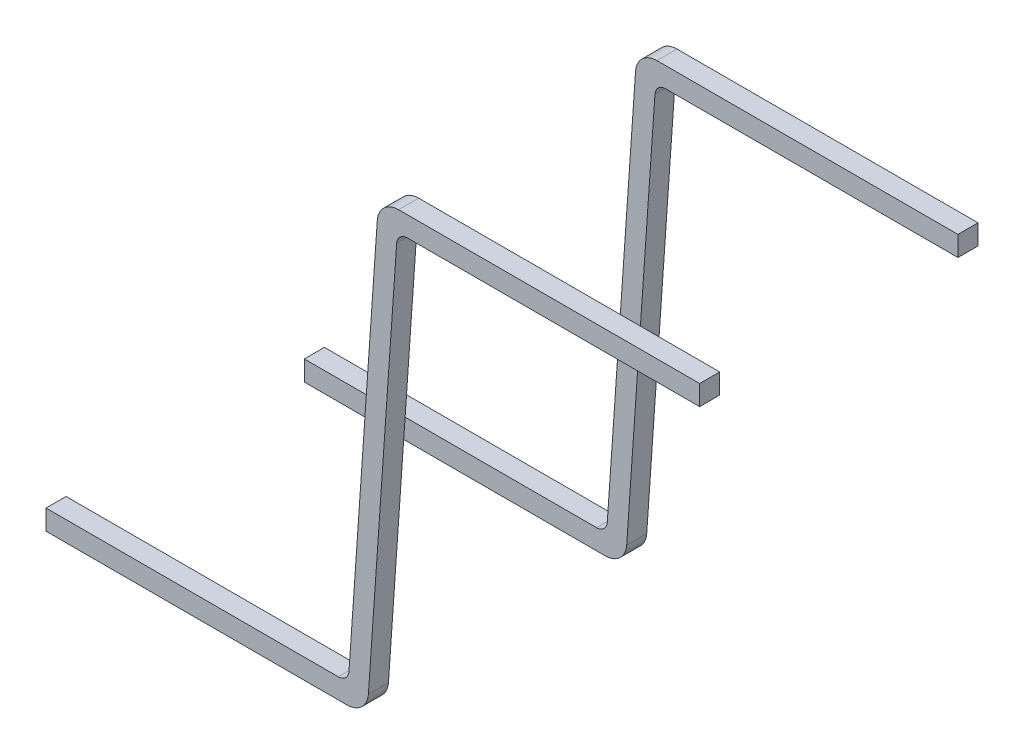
ISO-10303-21;
HEADER;
FILE_DESCRIPTION(('STEP AP214'),'2;1');
FILE_NAME('part.step','',(''),(''),'','','');
FILE_SCHEMA(('AUTOMOTIVE_DESIGN { 1 0 10303 214 1 1 1 1 }'));
ENDSEC;
DATA;
#1=APPLICATION_CONTEXT('core data for automotive mechanical design processes');
#2=APPLICATION_PROTOCOL_DEFINITION('international standard','automotive_design',2000,#1);
#3=PRODUCT_CONTEXT('',#1,'mechanical');
#4=PRODUCT('Part','Part','',(#3));
#5=PRODUCT_RELATED_PRODUCT_CATEGORY('part','',(#4));
#6=PRODUCT_DEFINITION_FORMATION('','',#4);
#7=PRODUCT_DEFINITION_CONTEXT('part definition',#1,'design');
#8=PRODUCT_DEFINITION('design','',#6,#7);
#9=PRODUCT_DEFINITION_SHAPE('','',#8);
#10=(LENGTH_UNIT() NAMED_UNIT(*) SI_UNIT(.MILLI.,.METRE.));
#11=(NAMED_UNIT(*) PLANE_ANGLE_UNIT() SI_UNIT($,.RADIAN.));
#12=(NAMED_UNIT(*) SI_UNIT($,.STERADIAN.) SOLID_ANGLE_UNIT());
#13=UNCERTAINTY_MEASURE_WITH_UNIT(LENGTH_MEASURE(1.E-05),#10,'distance_accuracy_value','');
#14=(GEOMETRIC_REPRESENTATION_CONTEXT(3) GLOBAL_UNCERTAINTY_ASSIGNED_CONTEXT((#13)) GLOBAL_UNIT_ASSIGNED_CONTEXT((#10,
#11,#12)) REPRESENTATION_CONTEXT('',''));
#15=CARTESIAN_POINT('',(0.,0.,0.));
#16=DIRECTION('',(0.,0.,1.));
#17=DIRECTION('',(1.,0.,0.));
#18=AXIS2_PLACEMENT_3D('',#15,#16,#17);
#19=CARTESIAN_POINT('',(0.,0.,-25.8953));
#20=DIRECTION('',(0.,-1.,0.));
#21=DIRECTION('',(1.,0.,0.));
#22=AXIS2_PLACEMENT_3D('',#19,#20,#21);
#23=PLANE('',#22);
#24=DIRECTION('',(-1.,0.,0.));
#25=VECTOR('',#24,1.);
#26=CARTESIAN_POINT('',(0.,0.,-25.8953));
#27=LINE('',#26,#25);
#28=CARTESIAN_POINT('',(-2.36858831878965,0.,-25.8953));
#29=VERTEX_POINT('',#28);
#30=CARTESIAN_POINT('',(-71.7588969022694,0.,-25.8953));
#31=VERTEX_POINT('',#30);
#32=EDGE_CURVE('E132',#29,#31,#27,.T.);
#33=ORIENTED_EDGE('',*,*,#32,.F.);
#34=DIRECTION('',(0.,0.,-1.));
#35=VECTOR('',#34,1.);
#36=CARTESIAN_POINT('',(-2.36858831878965,0.,-30.6578));
#37=LINE('',#36,#35);
#38=CARTESIAN_POINT('',(-2.36858831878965,0.,-30.6578));
#39=VERTEX_POINT('',#38);
#40=EDGE_CURVE('E158',#29,#39,#37,.T.);
#41=ORIENTED_EDGE('',*,*,#40,.T.);
#42=DIRECTION('',(-1.,0.,0.));
#43=VECTOR('',#42,1.);
#44=CARTESIAN_POINT('',(0.,0.,-30.6578));
#45=LINE('',#44,#43);
#46=CARTESIAN_POINT('',(-71.7588969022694,0.,-30.6578));
#47=VERTEX_POINT('',#46);
#48=EDGE_CURVE('E156',#39,#47,#45,.T.);
#49=ORIENTED_EDGE('',*,*,#48,.T.);
#50=DIRECTION('',(0.,0.,-1.));
#51=VECTOR('',#50,1.);
#52=CARTESIAN_POINT('',(-71.7588969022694,0.,-25.8953));
#53=LINE('',#52,#51);
#54=EDGE_CURVE('E149',#31,#47,#53,.T.);
#55=ORIENTED_EDGE('',*,*,#54,.F.);
#56=EDGE_LOOP('',(#33,#41,#49,#55));
#57=FACE_BOUND('',#56,.T.);
#58=ADVANCED_FACE('F45',(#57),#23,.F.);
#59=CARTESIAN_POINT('',(-71.7588969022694,-4.76250000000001,-25.8953));
#60=DIRECTION('',(1.,0.,0.));
#61=DIRECTION('',(0.,0.,-1.));
#62=AXIS2_PLACEMENT_3D('',#59,#60,#61);
#63=PLANE('',#62);
#64=DIRECTION('',(0.,-1.,0.));
#65=VECTOR('',#64,1.);
#66=CARTESIAN_POINT('',(-71.7588969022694,-4.76250000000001,-30.6578));
#67=LINE('',#66,#65);
#68=CARTESIAN_POINT('',(-71.7588969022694,-4.76250000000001,-30.6578));
#69=VERTEX_POINT('',#68);
#70=EDGE_CURVE('E233',#47,#69,#67,.T.);
#71=ORIENTED_EDGE('',*,*,#70,.T.);
#72=DIRECTION('',(0.,0.,-1.));
#73=VECTOR('',#72,1.);
#74=CARTESIAN_POINT('',(-71.7588969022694,-4.76250000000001,-25.8953));
#75=LINE('',#74,#73);
#76=CARTESIAN_POINT('',(-71.7588969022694,-4.76250000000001,-25.8953));
#77=VERTEX_POINT('',#76);
#78=EDGE_CURVE('E151',#77,#69,#75,.T.);
#79=ORIENTED_EDGE('',*,*,#78,.F.);
#80=DIRECTION('',(0.,-1.,0.));
#81=VECTOR('',#80,1.);
#82=CARTESIAN_POINT('',(-71.7588969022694,-4.76250000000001,-25.8953));
#83=LINE('',#82,#81);
#84=EDGE_CURVE('E136',#31,#77,#83,.T.);
#85=ORIENTED_EDGE('',*,*,#84,.F.);
#86=ORIENTED_EDGE('',*,*,#54,.T.);
#87=EDGE_LOOP('',(#71,#79,#85,#86));
#88=FACE_BOUND('',#87,.T.);
#89=ADVANCED_FACE('F148',(#88),#63,.F.);
#90=CARTESIAN_POINT('',(4.4411030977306,-4.7625,-25.8953));
#91=DIRECTION('',(0.,1.,0.));
#92=DIRECTION('',(-1.,0.,0.));
#93=AXIS2_PLACEMENT_3D('',#90,#91,#92);
#94=PLANE('',#93);
#95=DIRECTION('',(1.,0.,0.));
#96=VECTOR('',#95,1.);
#97=CARTESIAN_POINT('',(4.4411030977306,-4.7625,-30.6578));
#98=LINE('',#97,#96);
#99=CARTESIAN_POINT('',(-0.296073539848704,-4.7625,-30.6578));
#100=VERTEX_POINT('',#99);
#101=EDGE_CURVE('E230',#69,#100,#98,.T.);
#102=ORIENTED_EDGE('',*,*,#101,.T.);
#103=DIRECTION('',(0.,0.,-1.));
#104=VECTOR('',#103,1.);
#105=CARTESIAN_POINT('',(-0.296073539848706,-4.7625,-25.8953));
#106=LINE('',#105,#104);
#107=CARTESIAN_POINT('',(-0.296073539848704,-4.7625,-25.8953));
#108=VERTEX_POINT('',#107);
#109=EDGE_CURVE('E190',#100,#108,#106,.F.);
#110=ORIENTED_EDGE('',*,*,#109,.T.);
#111=DIRECTION('',(1.,0.,0.));
#112=VECTOR('',#111,1.);
#113=CARTESIAN_POINT('',(4.4411030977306,-4.7625,-25.8953));
#114=LINE('',#113,#112);
#115=EDGE_CURVE('E153',#77,#108,#114,.T.);
#116=ORIENTED_EDGE('',*,*,#115,.F.);
#117=ORIENTED_EDGE('',*,*,#78,.T.);
#118=EDGE_LOOP('',(#102,#110,#116,#117));
#119=FACE_BOUND('',#118,.T.);
#120=ADVANCED_FACE('F268',(#119),#94,.F.);
#121=CARTESIAN_POINT('',(4.4411030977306,-4.7625,-25.8953));
#122=DIRECTION('',(-0.997564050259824,0.0697564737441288,0.));
#123=DIRECTION('',(-0.0697564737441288,-0.997564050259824,0.));
#124=AXIS2_PLACEMENT_3D('',#121,#122,#123);
#125=PLANE('',#124);
#126=DIRECTION('',(0.0697564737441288,0.997564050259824,0.));
#127=VECTOR('',#126,1.);
#128=CARTESIAN_POINT('',(4.4411030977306,-4.7625,-25.8953));
#129=LINE('',#128,#127);
#130=CARTESIAN_POINT('',(4.7715518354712,-0.0368628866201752,-25.8953));
#131=VERTEX_POINT('',#130);
#132=CARTESIAN_POINT('',(11.4914516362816,96.0621814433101,-25.8953));
#133=VERTEX_POINT('',#132);
#134=EDGE_CURVE('E242',#131,#133,#129,.T.);
#135=ORIENTED_EDGE('',*,*,#134,.F.);
#136=DIRECTION('',(0.,0.,-1.));
#137=VECTOR('',#136,1.);
#138=CARTESIAN_POINT('',(4.7715518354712,-0.0368628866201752,-25.8953));
#139=LINE('',#138,#137);
#140=CARTESIAN_POINT('',(4.7715518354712,-0.0368628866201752,-30.6578));
#141=VERTEX_POINT('',#140);
#142=EDGE_CURVE('E183',#131,#141,#139,.T.);
#143=ORIENTED_EDGE('',*,*,#142,.T.);
#144=DIRECTION('',(0.0697564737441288,0.997564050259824,0.));
#145=VECTOR('',#144,1.);
#146=CARTESIAN_POINT('',(4.4411030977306,-4.7625,-30.6578));
#147=LINE('',#146,#145);
#148=CARTESIAN_POINT('',(11.4914516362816,96.0621814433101,-30.6578));
#149=VERTEX_POINT('',#148);
#150=EDGE_CURVE('E226',#141,#149,#147,.T.);
#151=ORIENTED_EDGE('',*,*,#150,.T.);
#152=DIRECTION('',(0.,0.,-1.));
#153=VECTOR('',#152,1.);
#154=CARTESIAN_POINT('',(11.4914516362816,96.0621814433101,-25.8953));
#155=LINE('',#154,#153);
#156=EDGE_CURVE('E171',#149,#133,#155,.F.);
#157=ORIENTED_EDGE('',*,*,#156,.T.);
#158=EDGE_LOOP('',(#135,#143,#151,#157));
#159=FACE_BOUND('',#158,.T.);
#160=ADVANCED_FACE('F252',(#159),#125,.F.);
#161=CARTESIAN_POINT('',(11.6566760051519,98.425,-25.8953));
#162=DIRECTION('',(0.,1.,0.));
#163=DIRECTION('',(0.,0.,1.));
#164=AXIS2_PLACEMENT_3D('',#161,#162,#163);
#165=PLANE('',#164);
#166=DIRECTION('',(1.,0.,0.));
#167=VECTOR('',#166,1.);
#168=CARTESIAN_POINT('',(11.6566760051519,98.425,-25.8953));
#169=LINE('',#168,#167);
#170=CARTESIAN_POINT('',(14.0252643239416,98.425,-25.8953));
#171=VERTEX_POINT('',#170);
#172=CARTESIAN_POINT('',(83.4155729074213,98.425,-25.8953));
#173=VERTEX_POINT('',#172);
#174=EDGE_CURVE('E240',#171,#173,#169,.T.);
#175=ORIENTED_EDGE('',*,*,#174,.F.);
#176=DIRECTION('',(0.,0.,-1.));
#177=VECTOR('',#176,1.);
#178=CARTESIAN_POINT('',(14.0252643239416,98.425,-30.6578));
#179=LINE('',#178,#177);
#180=CARTESIAN_POINT('',(14.0252643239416,98.425,-30.6578));
#181=VERTEX_POINT('',#180);
#182=EDGE_CURVE('E168',#171,#181,#179,.T.);
#183=ORIENTED_EDGE('',*,*,#182,.T.);
#184=DIRECTION('',(1.,0.,0.));
#185=VECTOR('',#184,1.);
#186=CARTESIAN_POINT('',(11.6566760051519,98.425,-30.6578));
#187=LINE('',#186,#185);
#188=CARTESIAN_POINT('',(83.4155729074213,98.425,-30.6578));
#189=VERTEX_POINT('',#188);
#190=EDGE_CURVE('E225',#181,#189,#187,.T.);
#191=ORIENTED_EDGE('',*,*,#190,.T.);
#192=DIRECTION('',(0.,0.,-1.));
#193=VECTOR('',#192,1.);
#194=CARTESIAN_POINT('',(83.4155729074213,98.425,-25.8953));
#195=LINE('',#194,#193);
#196=EDGE_CURVE('E162',#173,#189,#195,.T.);
#197=ORIENTED_EDGE('',*,*,#196,.F.);
#198=EDGE_LOOP('',(#175,#183,#191,#197));
#199=FACE_BOUND('',#198,.T.);
#200=ADVANCED_FACE('F259',(#199),#165,.F.);
#201=CARTESIAN_POINT('',(83.4155729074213,98.425,-25.8953));
#202=DIRECTION('',(-1.,0.,0.));
#203=DIRECTION('',(0.,0.,1.));
#204=AXIS2_PLACEMENT_3D('',#201,#202,#203);
#205=PLANE('',#204);
#206=DIRECTION('',(0.,1.,0.));
#207=VECTOR('',#206,1.);
#208=CARTESIAN_POINT('',(83.4155729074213,98.425,-30.6578));
#209=LINE('',#208,#207);
#210=CARTESIAN_POINT('',(83.4155729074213,103.1875,-30.6578));
#211=VERTEX_POINT('',#210);
#212=EDGE_CURVE('E208',#189,#211,#209,.T.);
#213=ORIENTED_EDGE('',*,*,#212,.T.);
#214=DIRECTION('',(0.,0.,-1.));
#215=VECTOR('',#214,1.);
#216=CARTESIAN_POINT('',(83.4155729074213,103.1875,-25.8953));
#217=LINE('',#216,#215);
#218=CARTESIAN_POINT('',(83.4155729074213,103.1875,-25.8953));
#219=VERTEX_POINT('',#218);
#220=EDGE_CURVE('E212',#219,#211,#217,.T.);
#221=ORIENTED_EDGE('',*,*,#220,.F.);
#222=DIRECTION('',(0.,1.,0.));
#223=VECTOR('',#222,1.);
#224=CARTESIAN_POINT('',(83.4155729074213,98.425,-25.8953));
#225=LINE('',#224,#223);
#226=EDGE_CURVE('E221',#173,#219,#225,.T.);
#227=ORIENTED_EDGE('',*,*,#226,.F.);
#228=ORIENTED_EDGE('',*,*,#196,.T.);
#229=EDGE_LOOP('',(#213,#221,#227,#228));
#230=FACE_BOUND('',#229,.T.);
#231=ADVANCED_FACE('F219',(#230),#205,.F.);
#232=CARTESIAN_POINT('',(7.21557290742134,103.1875,-25.8953));
#233=DIRECTION('',(0.,-1.,0.));
#234=DIRECTION('',(0.,0.,-1.));
#235=AXIS2_PLACEMENT_3D('',#232,#233,#234);
#236=PLANE('',#235);
#237=DIRECTION('',(-1.,0.,0.));
#238=VECTOR('',#237,1.);
#239=CARTESIAN_POINT('',(7.21557290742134,103.1875,-30.6578));
#240=LINE('',#239,#238);
#241=CARTESIAN_POINT('',(11.9527495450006,103.1875,-30.6578));
#242=VERTEX_POINT('',#241);
#243=EDGE_CURVE('E206',#211,#242,#240,.T.);
#244=ORIENTED_EDGE('',*,*,#243,.T.);
#245=DIRECTION('',(0.,0.,-1.));
#246=VECTOR('',#245,1.);
#247=CARTESIAN_POINT('',(11.9527495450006,103.1875,-25.8953));
#248=LINE('',#247,#246);
#249=CARTESIAN_POINT('',(11.9527495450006,103.1875,-25.8953));
#250=VERTEX_POINT('',#249);
#251=EDGE_CURVE('E12',#242,#250,#248,.F.);
#252=ORIENTED_EDGE('',*,*,#251,.T.);
#253=DIRECTION('',(-1.,0.,0.));
#254=VECTOR('',#253,1.);
#255=CARTESIAN_POINT('',(7.21557290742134,103.1875,-25.8953));
#256=LINE('',#255,#254);
#257=EDGE_CURVE('E237',#219,#250,#256,.T.);
#258=ORIENTED_EDGE('',*,*,#257,.F.);
#259=ORIENTED_EDGE('',*,*,#220,.T.);
#260=EDGE_LOOP('',(#244,#252,#258,#259));
#261=FACE_BOUND('',#260,.T.);
#262=ADVANCED_FACE('F266',(#261),#236,.F.);
#263=CARTESIAN_POINT('',(0.,0.,-25.8953));
#264=DIRECTION('',(0.997564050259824,-0.0697564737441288,0.));
#265=DIRECTION('',(0.0697564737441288,0.997564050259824,0.));
#266=AXIS2_PLACEMENT_3D('',#263,#264,#265);
#267=PLANE('',#266);
#268=DIRECTION('',(-0.0697564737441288,-0.997564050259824,0.));
#269=VECTOR('',#268,1.);
#270=CARTESIAN_POINT('',(0.,0.,-25.8953));
#271=LINE('',#270,#269);
#272=CARTESIAN_POINT('',(6.88512416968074,98.4618628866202,-25.8953));
#273=VERTEX_POINT('',#272);
#274=CARTESIAN_POINT('',(0.1652243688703,2.36281855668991,-25.8953));
#275=VERTEX_POINT('',#274);
#276=EDGE_CURVE('E199',#273,#275,#271,.T.);
#277=ORIENTED_EDGE('',*,*,#276,.F.);
#278=DIRECTION('',(0.,0.,-1.));
#279=VECTOR('',#278,1.);
#280=CARTESIAN_POINT('',(6.88512416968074,98.4618628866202,-25.8953));
#281=LINE('',#280,#279);
#282=CARTESIAN_POINT('',(6.88512416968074,98.4618628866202,-30.6578));
#283=VERTEX_POINT('',#282);
#284=EDGE_CURVE('E53',#273,#283,#281,.T.);
#285=ORIENTED_EDGE('',*,*,#284,.T.);
#286=DIRECTION('',(-0.0697564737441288,-0.997564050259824,0.));
#287=VECTOR('',#286,1.);
#288=CARTESIAN_POINT('',(0.,0.,-30.6578));
#289=LINE('',#288,#287);
#290=CARTESIAN_POINT('',(0.1652243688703,2.36281855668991,-30.6578));
#291=VERTEX_POINT('',#290);
#292=EDGE_CURVE('E144',#283,#291,#289,.T.);
#293=ORIENTED_EDGE('',*,*,#292,.T.);
#294=DIRECTION('',(0.,0.,-1.));
#295=VECTOR('',#294,1.);
#296=CARTESIAN_POINT('',(0.1652243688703,2.36281855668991,-25.8953));
#297=LINE('',#296,#295);
#298=EDGE_CURVE('E160',#291,#275,#297,.F.);
#299=ORIENTED_EDGE('',*,*,#298,.T.);
#300=EDGE_LOOP('',(#277,#285,#293,#299));
#301=FACE_BOUND('',#300,.T.);
#302=ADVANCED_FACE('F198',(#301),#267,.F.);
#303=CARTESIAN_POINT('',(0.,0.,-25.8953));
#304=DIRECTION('',(0.,0.,-1.));
#305=DIRECTION('',(-1.,0.,0.));
#306=AXIS2_PLACEMENT_3D('',#303,#304,#305);
#307=PLANE('',#306);
#308=ORIENTED_EDGE('',*,*,#115,.T.);
#309=CARTESIAN_POINT('',(-0.296073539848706,0.3175,-25.8953));
#310=DIRECTION('',(0.,0.,-1.));
#311=DIRECTION('',(-1.,0.,0.));
#312=AXIS2_PLACEMENT_3D('',#309,#310,#311);
#313=CIRCLE('',#312,5.08);
#314=EDGE_CURVE('E193',#108,#131,#313,.F.);
#315=ORIENTED_EDGE('',*,*,#314,.T.);
#316=ORIENTED_EDGE('',*,*,#134,.T.);
#317=CARTESIAN_POINT('',(14.0252643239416,95.885,-25.8953));
#318=DIRECTION('',(0.,0.,-1.));
#319=DIRECTION('',(-1.,0.,0.));
#320=AXIS2_PLACEMENT_3D('',#317,#318,#319);
#321=CIRCLE('',#320,2.54);
#322=EDGE_CURVE('E181',#133,#171,#321,.T.);
#323=ORIENTED_EDGE('',*,*,#322,.T.);
#324=ORIENTED_EDGE('',*,*,#174,.T.);
#325=ORIENTED_EDGE('',*,*,#226,.T.);
#326=ORIENTED_EDGE('',*,*,#257,.T.);
#327=CARTESIAN_POINT('',(11.9527495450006,98.1075,-25.8953));
#328=DIRECTION('',(0.,0.,-1.));
#329=DIRECTION('',(-1.,0.,0.));
#330=AXIS2_PLACEMENT_3D('',#327,#328,#329);
#331=CIRCLE('',#330,5.08);
#332=EDGE_CURVE('E65',#250,#273,#331,.F.);
#333=ORIENTED_EDGE('',*,*,#332,.T.);
#334=ORIENTED_EDGE('',*,*,#276,.T.);
#335=CARTESIAN_POINT('',(-2.36858831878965,2.54,-25.8953));
#336=DIRECTION('',(0.,0.,-1.));
#337=DIRECTION('',(-1.,0.,0.));
#338=AXIS2_PLACEMENT_3D('',#335,#336,#337);
#339=CIRCLE('',#338,2.54);
#340=EDGE_CURVE('E139',#275,#29,#339,.T.);
#341=ORIENTED_EDGE('',*,*,#340,.T.);
#342=ORIENTED_EDGE('',*,*,#32,.T.);
#343=ORIENTED_EDGE('',*,*,#84,.T.);
#344=EDGE_LOOP('',(#308,#315,#316,#323,#324,#325,#326,#333,#334,#341,#342,#343));
#345=FACE_BOUND('',#344,.T.);
#346=ADVANCED_FACE('F135',(#345),#307,.F.);
#347=CARTESIAN_POINT('',(0.,0.,-30.6578));
#348=DIRECTION('',(0.,0.,-1.));
#349=DIRECTION('',(-1.,0.,0.));
#350=AXIS2_PLACEMENT_3D('',#347,#348,#349);
#351=PLANE('',#350);
#352=ORIENTED_EDGE('',*,*,#150,.F.);
#353=CARTESIAN_POINT('',(-0.296073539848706,0.3175,-30.6578));
#354=DIRECTION('',(0.,0.,-1.));
#355=DIRECTION('',(-1.,0.,0.));
#356=AXIS2_PLACEMENT_3D('',#353,#354,#355);
#357=CIRCLE('',#356,5.08);
#358=EDGE_CURVE('E188',#141,#100,#357,.T.);
#359=ORIENTED_EDGE('',*,*,#358,.T.);
#360=ORIENTED_EDGE('',*,*,#101,.F.);
#361=ORIENTED_EDGE('',*,*,#70,.F.);
#362=ORIENTED_EDGE('',*,*,#48,.F.);
#363=CARTESIAN_POINT('',(-2.36858831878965,2.54,-30.6578));
#364=DIRECTION('',(0.,0.,-1.));
#365=DIRECTION('',(-1.,0.,0.));
#366=AXIS2_PLACEMENT_3D('',#363,#364,#365);
#367=CIRCLE('',#366,2.54);
#368=EDGE_CURVE('E174',#39,#291,#367,.F.);
#369=ORIENTED_EDGE('',*,*,#368,.T.);
#370=ORIENTED_EDGE('',*,*,#292,.F.);
#371=CARTESIAN_POINT('',(11.9527495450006,98.1075,-30.6578));
#372=DIRECTION('',(0.,0.,-1.));
#373=DIRECTION('',(-1.,0.,0.));
#374=AXIS2_PLACEMENT_3D('',#371,#372,#373);
#375=CIRCLE('',#374,5.08);
#376=EDGE_CURVE('E186',#283,#242,#375,.T.);
#377=ORIENTED_EDGE('',*,*,#376,.T.);
#378=ORIENTED_EDGE('',*,*,#243,.F.);
#379=ORIENTED_EDGE('',*,*,#212,.F.);
#380=ORIENTED_EDGE('',*,*,#190,.F.);
#381=CARTESIAN_POINT('',(14.0252643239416,95.885,-30.6578));
#382=DIRECTION('',(0.,0.,-1.));
#383=DIRECTION('',(-1.,0.,0.));
#384=AXIS2_PLACEMENT_3D('',#381,#382,#383);
#385=CIRCLE('',#384,2.54);
#386=EDGE_CURVE('E178',#181,#149,#385,.F.);
#387=ORIENTED_EDGE('',*,*,#386,.T.);
#388=EDGE_LOOP('',(#352,#359,#360,#361,#362,#369,#370,#377,#378,#379,#380,#387));
#389=FACE_BOUND('',#388,.T.);
#390=ADVANCED_FACE('F203',(#389),#351,.T.);
#391=CARTESIAN_POINT('',(-2.36858831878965,2.54,-25.8953));
#392=DIRECTION('',(0.,0.,1.));
#393=DIRECTION('',(1.,0.,0.));
#394=AXIS2_PLACEMENT_3D('',#391,#392,#393);
#395=CYLINDRICAL_SURFACE('',#394,2.54);
#396=ORIENTED_EDGE('',*,*,#340,.F.);
#397=ORIENTED_EDGE('',*,*,#298,.F.);
#398=ORIENTED_EDGE('',*,*,#368,.F.);
#399=ORIENTED_EDGE('',*,*,#40,.F.);
#400=EDGE_LOOP('',(#396,#397,#398,#399));
#401=FACE_BOUND('',#400,.T.);
#402=ADVANCED_FACE('F278',(#401),#395,.F.);
#403=CARTESIAN_POINT('',(14.0252643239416,95.885,-25.8953));
#404=DIRECTION('',(0.,0.,1.));
#405=DIRECTION('',(1.,0.,0.));
#406=AXIS2_PLACEMENT_3D('',#403,#404,#405);
#407=CYLINDRICAL_SURFACE('',#406,2.54);
#408=ORIENTED_EDGE('',*,*,#322,.F.);
#409=ORIENTED_EDGE('',*,*,#156,.F.);
#410=ORIENTED_EDGE('',*,*,#386,.F.);
#411=ORIENTED_EDGE('',*,*,#182,.F.);
#412=EDGE_LOOP('',(#408,#409,#410,#411));
#413=FACE_BOUND('',#412,.T.);
#414=ADVANCED_FACE('F258',(#413),#407,.F.);
#415=CARTESIAN_POINT('',(-0.296073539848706,0.3175,-25.8953));
#416=DIRECTION('',(0.,0.,-1.));
#417=DIRECTION('',(-1.,0.,0.));
#418=AXIS2_PLACEMENT_3D('',#415,#416,#417);
#419=CYLINDRICAL_SURFACE('',#418,5.08);
#420=ORIENTED_EDGE('',*,*,#314,.F.);
#421=ORIENTED_EDGE('',*,*,#109,.F.);
#422=ORIENTED_EDGE('',*,*,#358,.F.);
#423=ORIENTED_EDGE('',*,*,#142,.F.);
#424=EDGE_LOOP('',(#420,#421,#422,#423));
#425=FACE_BOUND('',#424,.T.);
#426=ADVANCED_FACE('F250',(#425),#419,.T.);
#427=CARTESIAN_POINT('',(11.9527495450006,98.1075,-25.8953));
#428=DIRECTION('',(0.,0.,-1.));
#429=DIRECTION('',(-1.,0.,0.));
#430=AXIS2_PLACEMENT_3D('',#427,#428,#429);
#431=CYLINDRICAL_SURFACE('',#430,5.08);
#432=ORIENTED_EDGE('',*,*,#332,.F.);
#433=ORIENTED_EDGE('',*,*,#251,.F.);
#434=ORIENTED_EDGE('',*,*,#376,.F.);
#435=ORIENTED_EDGE('',*,*,#284,.F.);
#436=EDGE_LOOP('',(#432,#433,#434,#435));
#437=FACE_BOUND('',#436,.T.);
#438=ADVANCED_FACE('F47',(#437),#431,.T.);
#439=CLOSED_SHELL('',(#58,#89,#120,#160,#200,#231,#262,#302,#346,#390,#402,#414,#426,#438));
#440=MANIFOLD_SOLID_BREP('B2',#439);
#441=CARTESIAN_POINT('',(0.,0.,35.4203));
#442=DIRECTION('',(0.,-1.,0.));
#443=DIRECTION('',(1.,0.,0.));
#444=AXIS2_PLACEMENT_3D('',#441,#442,#443);
#445=PLANE('',#444);
#446=DIRECTION('',(-1.,0.,0.));
#447=VECTOR('',#446,1.);
#448=CARTESIAN_POINT('',(0.,0.,35.4203));
#449=LINE('',#448,#447);
#450=CARTESIAN_POINT('',(-2.36858831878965,0.,35.4203));
#451=VERTEX_POINT('',#450);
#452=CARTESIAN_POINT('',(-71.7588969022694,0.,35.4203));
#453=VERTEX_POINT('',#452);
#454=EDGE_CURVE('E464',#451,#453,#449,.T.);
#455=ORIENTED_EDGE('',*,*,#454,.F.);
#456=DIRECTION('',(0.,0.,-1.));
#457=VECTOR('',#456,1.);
#458=CARTESIAN_POINT('',(-2.36858831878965,0.,30.6578));
#459=LINE('',#458,#457);
#460=CARTESIAN_POINT('',(-2.36858831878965,0.,30.6578));
#461=VERTEX_POINT('',#460);
#462=EDGE_CURVE('E500',#451,#461,#459,.T.);
#463=ORIENTED_EDGE('',*,*,#462,.T.);
#464=DIRECTION('',(-1.,0.,0.));
#465=VECTOR('',#464,1.);
#466=CARTESIAN_POINT('',(0.,0.,30.6578));
#467=LINE('',#466,#465);
#468=CARTESIAN_POINT('',(-71.7588969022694,0.,30.6578));
#469=VERTEX_POINT('',#468);
#470=EDGE_CURVE('E487',#461,#469,#467,.T.);
#471=ORIENTED_EDGE('',*,*,#470,.T.);
#472=DIRECTION('',(0.,0.,-1.));
#473=VECTOR('',#472,1.);
#474=CARTESIAN_POINT('',(-71.7588969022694,0.,35.4203));
#475=LINE('',#474,#473);
#476=EDGE_CURVE('E481',#453,#469,#475,.T.);
#477=ORIENTED_EDGE('',*,*,#476,.F.);
#478=EDGE_LOOP('',(#455,#463,#471,#477));
#479=FACE_BOUND('',#478,.T.);
#480=ADVANCED_FACE('F377',(#479),#445,.F.);
#481=CARTESIAN_POINT('',(-71.7588969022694,-4.76250000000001,35.4203));
#482=DIRECTION('',(1.,0.,0.));
#483=DIRECTION('',(0.,0.,-1.));
#484=AXIS2_PLACEMENT_3D('',#481,#482,#483);
#485=PLANE('',#484);
#486=DIRECTION('',(0.,-1.,0.));
#487=VECTOR('',#486,1.);
#488=CARTESIAN_POINT('',(-71.7588969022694,-4.76250000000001,30.6578));
#489=LINE('',#488,#487);
#490=CARTESIAN_POINT('',(-71.7588969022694,-4.76250000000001,30.6578));
#491=VERTEX_POINT('',#490);
#492=EDGE_CURVE('E544',#469,#491,#489,.T.);
#493=ORIENTED_EDGE('',*,*,#492,.T.);
#494=DIRECTION('',(0.,0.,-1.));
#495=VECTOR('',#494,1.);
#496=CARTESIAN_POINT('',(-71.7588969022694,-4.76250000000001,35.4203));
#497=LINE('',#496,#495);
#498=CARTESIAN_POINT('',(-71.7588969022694,-4.76250000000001,35.4203));
#499=VERTEX_POINT('',#498);
#500=EDGE_CURVE('E483',#499,#491,#497,.T.);
#501=ORIENTED_EDGE('',*,*,#500,.F.);
#502=DIRECTION('',(0.,-1.,0.));
#503=VECTOR('',#502,1.);
#504=CARTESIAN_POINT('',(-71.7588969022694,-4.76250000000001,35.4203));
#505=LINE('',#504,#503);
#506=EDGE_CURVE('E468',#453,#499,#505,.T.);
#507=ORIENTED_EDGE('',*,*,#506,.F.);
#508=ORIENTED_EDGE('',*,*,#476,.T.);
#509=EDGE_LOOP('',(#493,#501,#507,#508));
#510=FACE_BOUND('',#509,.T.);
#511=ADVANCED_FACE('F480',(#510),#485,.F.);
#512=CARTESIAN_POINT('',(4.4411030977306,-4.7625,35.4203));
#513=DIRECTION('',(0.,1.,0.));
#514=DIRECTION('',(-1.,0.,0.));
#515=AXIS2_PLACEMENT_3D('',#512,#513,#514);
#516=PLANE('',#515);
#517=DIRECTION('',(1.,0.,0.));
#518=VECTOR('',#517,1.);
#519=CARTESIAN_POINT('',(4.4411030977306,-4.7625,30.6578));
#520=LINE('',#519,#518);
#521=CARTESIAN_POINT('',(-0.296073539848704,-4.7625,30.6578));
#522=VERTEX_POINT('',#521);
#523=EDGE_CURVE('E540',#491,#522,#520,.T.);
#524=ORIENTED_EDGE('',*,*,#523,.T.);
#525=DIRECTION('',(0.,0.,-1.));
#526=VECTOR('',#525,1.);
#527=CARTESIAN_POINT('',(-0.296073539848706,-4.7625,35.4203));
#528=LINE('',#527,#526);
#529=CARTESIAN_POINT('',(-0.296073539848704,-4.7625,35.4203));
#530=VERTEX_POINT('',#529);
#531=EDGE_CURVE('E43',#522,#530,#528,.F.);
#532=ORIENTED_EDGE('',*,*,#531,.T.);
#533=DIRECTION('',(1.,0.,0.));
#534=VECTOR('',#533,1.);
#535=CARTESIAN_POINT('',(4.4411030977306,-4.7625,35.4203));
#536=LINE('',#535,#534);
#537=EDGE_CURVE('E484',#499,#530,#536,.T.);
#538=ORIENTED_EDGE('',*,*,#537,.F.);
#539=ORIENTED_EDGE('',*,*,#500,.T.);
#540=EDGE_LOOP('',(#524,#532,#538,#539));
#541=FACE_BOUND('',#540,.T.);
#542=ADVANCED_FACE('F584',(#541),#516,.F.);
#543=CARTESIAN_POINT('',(4.4411030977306,-4.7625,35.4203));
#544=DIRECTION('',(-0.997564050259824,0.0697564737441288,0.));
#545=DIRECTION('',(-0.0697564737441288,-0.997564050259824,0.));
#546=AXIS2_PLACEMENT_3D('',#543,#544,#545);
#547=PLANE('',#546);
#548=DIRECTION('',(0.0697564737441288,0.997564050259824,0.));
#549=VECTOR('',#548,1.);
#550=CARTESIAN_POINT('',(4.4411030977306,-4.7625,35.4203));
#551=LINE('',#550,#549);
#552=CARTESIAN_POINT('',(4.7715518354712,-0.0368628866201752,35.4203));
#553=VERTEX_POINT('',#552);
#554=CARTESIAN_POINT('',(11.4914516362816,96.0621814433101,35.4203));
#555=VERTEX_POINT('',#554);
#556=EDGE_CURVE('E531',#553,#555,#551,.T.);
#557=ORIENTED_EDGE('',*,*,#556,.F.);
#558=DIRECTION('',(0.,0.,-1.));
#559=VECTOR('',#558,1.);
#560=CARTESIAN_POINT('',(4.7715518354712,-0.0368628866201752,35.4203));
#561=LINE('',#560,#559);
#562=CARTESIAN_POINT('',(4.7715518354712,-0.0368628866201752,30.6578));
#563=VERTEX_POINT('',#562);
#564=EDGE_CURVE('E385',#553,#563,#561,.T.);
#565=ORIENTED_EDGE('',*,*,#564,.T.);
#566=DIRECTION('',(0.0697564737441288,0.997564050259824,0.));
#567=VECTOR('',#566,1.);
#568=CARTESIAN_POINT('',(4.4411030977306,-4.7625,30.6578));
#569=LINE('',#568,#567);
#570=CARTESIAN_POINT('',(11.4914516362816,96.0621814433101,30.6578));
#571=VERTEX_POINT('',#570);
#572=EDGE_CURVE('E530',#563,#571,#569,.T.);
#573=ORIENTED_EDGE('',*,*,#572,.T.);
#574=DIRECTION('',(0.,0.,-1.));
#575=VECTOR('',#574,1.);
#576=CARTESIAN_POINT('',(11.4914516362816,96.0621814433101,35.4203));
#577=LINE('',#576,#575);
#578=EDGE_CURVE('E492',#571,#555,#577,.F.);
#579=ORIENTED_EDGE('',*,*,#578,.T.);
#580=EDGE_LOOP('',(#557,#565,#573,#579));
#581=FACE_BOUND('',#580,.T.);
#582=ADVANCED_FACE('F529',(#581),#547,.F.);
#583=CARTESIAN_POINT('',(11.6566760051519,98.425,35.4203));
#584=DIRECTION('',(0.,1.,0.));
#585=DIRECTION('',(0.,0.,1.));
#586=AXIS2_PLACEMENT_3D('',#583,#584,#585);
#587=PLANE('',#586);
#588=DIRECTION('',(1.,0.,0.));
#589=VECTOR('',#588,1.);
#590=CARTESIAN_POINT('',(11.6566760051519,98.425,35.4203));
#591=LINE('',#590,#589);
#592=CARTESIAN_POINT('',(14.0252643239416,98.425,35.4203));
#593=VERTEX_POINT('',#592);
#594=CARTESIAN_POINT('',(83.4155729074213,98.425,35.4203));
#595=VERTEX_POINT('',#594);
#596=EDGE_CURVE('E586',#593,#595,#591,.T.);
#597=ORIENTED_EDGE('',*,*,#596,.F.);
#598=DIRECTION('',(0.,0.,-1.));
#599=VECTOR('',#598,1.);
#600=CARTESIAN_POINT('',(14.0252643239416,98.425,30.6578));
#601=LINE('',#600,#599);
#602=CARTESIAN_POINT('',(14.0252643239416,98.425,30.6578));
#603=VERTEX_POINT('',#602);
#604=EDGE_CURVE('E489',#593,#603,#601,.T.);
#605=ORIENTED_EDGE('',*,*,#604,.T.);
#606=DIRECTION('',(1.,0.,0.));
#607=VECTOR('',#606,1.);
#608=CARTESIAN_POINT('',(11.6566760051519,98.425,30.6578));
#609=LINE('',#608,#607);
#610=CARTESIAN_POINT('',(83.4155729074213,98.425,30.6578));
#611=VERTEX_POINT('',#610);
#612=EDGE_CURVE('E539',#603,#611,#609,.T.);
#613=ORIENTED_EDGE('',*,*,#612,.T.);
#614=DIRECTION('',(0.,0.,-1.));
#615=VECTOR('',#614,1.);
#616=CARTESIAN_POINT('',(83.4155729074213,98.425,35.4203));
#617=LINE('',#616,#615);
#618=EDGE_CURVE('E494',#595,#611,#617,.T.);
#619=ORIENTED_EDGE('',*,*,#618,.F.);
#620=EDGE_LOOP('',(#597,#605,#613,#619));
#621=FACE_BOUND('',#620,.T.);
#622=ADVANCED_FACE('F591',(#621),#587,.F.);
#623=CARTESIAN_POINT('',(83.4155729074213,98.425,35.4203));
#624=DIRECTION('',(-1.,0.,0.));
#625=DIRECTION('',(0.,0.,1.));
#626=AXIS2_PLACEMENT_3D('',#623,#624,#625);
#627=PLANE('',#626);
#628=DIRECTION('',(0.,1.,0.));
#629=VECTOR('',#628,1.);
#630=CARTESIAN_POINT('',(83.4155729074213,98.425,30.6578));
#631=LINE('',#630,#629);
#632=CARTESIAN_POINT('',(83.4155729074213,103.1875,30.6578));
#633=VERTEX_POINT('',#632);
#634=EDGE_CURVE('E542',#611,#633,#631,.T.);
#635=ORIENTED_EDGE('',*,*,#634,.T.);
#636=DIRECTION('',(0.,0.,-1.));
#637=VECTOR('',#636,1.);
#638=CARTESIAN_POINT('',(83.4155729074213,103.1875,35.4203));
#639=LINE('',#638,#637);
#640=CARTESIAN_POINT('',(83.4155729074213,103.1875,35.4203));
#641=VERTEX_POINT('',#640);
#642=EDGE_CURVE('E553',#641,#633,#639,.T.);
#643=ORIENTED_EDGE('',*,*,#642,.F.);
#644=DIRECTION('',(0.,1.,0.));
#645=VECTOR('',#644,1.);
#646=CARTESIAN_POINT('',(83.4155729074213,98.425,35.4203));
#647=LINE('',#646,#645);
#648=EDGE_CURVE('E563',#595,#641,#647,.T.);
#649=ORIENTED_EDGE('',*,*,#648,.F.);
#650=ORIENTED_EDGE('',*,*,#618,.T.);
#651=EDGE_LOOP('',(#635,#643,#649,#650));
#652=FACE_BOUND('',#651,.T.);
#653=ADVANCED_FACE('F561',(#652),#627,.F.);
#654=CARTESIAN_POINT('',(7.21557290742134,103.1875,35.4203));
#655=DIRECTION('',(0.,-1.,0.));
#656=DIRECTION('',(0.,0.,-1.));
#657=AXIS2_PLACEMENT_3D('',#654,#655,#656);
#658=PLANE('',#657);
#659=DIRECTION('',(-1.,0.,0.));
#660=VECTOR('',#659,1.);
#661=CARTESIAN_POINT('',(7.21557290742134,103.1875,30.6578));
#662=LINE('',#661,#660);
#663=CARTESIAN_POINT('',(11.9527495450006,103.1875,30.6578));
#664=VERTEX_POINT('',#663);
#665=EDGE_CURVE('E549',#633,#664,#662,.T.);
#666=ORIENTED_EDGE('',*,*,#665,.T.);
#667=DIRECTION('',(0.,0.,-1.));
#668=VECTOR('',#667,1.);
#669=CARTESIAN_POINT('',(11.9527495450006,103.1875,35.4203));
#670=LINE('',#669,#668);
#671=CARTESIAN_POINT('',(11.9527495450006,103.1875,35.4203));
#672=VERTEX_POINT('',#671);
#673=EDGE_CURVE('E521',#664,#672,#670,.F.);
#674=ORIENTED_EDGE('',*,*,#673,.T.);
#675=DIRECTION('',(-1.,0.,0.));
#676=VECTOR('',#675,1.);
#677=CARTESIAN_POINT('',(7.21557290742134,103.1875,35.4203));
#678=LINE('',#677,#676);
#679=EDGE_CURVE('E576',#641,#672,#678,.T.);
#680=ORIENTED_EDGE('',*,*,#679,.F.);
#681=ORIENTED_EDGE('',*,*,#642,.T.);
#682=EDGE_LOOP('',(#666,#674,#680,#681));
#683=FACE_BOUND('',#682,.T.);
#684=ADVANCED_FACE('F569',(#683),#658,.F.);
#685=CARTESIAN_POINT('',(0.,0.,35.4203));
#686=DIRECTION('',(0.997564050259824,-0.0697564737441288,0.));
#687=DIRECTION('',(0.0697564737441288,0.997564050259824,0.));
#688=AXIS2_PLACEMENT_3D('',#685,#686,#687);
#689=PLANE('',#688);
#690=DIRECTION('',(-0.0697564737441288,-0.997564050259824,0.));
#691=VECTOR('',#690,1.);
#692=CARTESIAN_POINT('',(0.,0.,35.4203));
#693=LINE('',#692,#691);
#694=CARTESIAN_POINT('',(6.88512416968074,98.4618628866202,35.4203));
#695=VERTEX_POINT('',#694);
#696=CARTESIAN_POINT('',(0.1652243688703,2.36281855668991,35.4203));
#697=VERTEX_POINT('',#696);
#698=EDGE_CURVE('E555',#695,#697,#693,.T.);
#699=ORIENTED_EDGE('',*,*,#698,.F.);
#700=DIRECTION('',(0.,0.,-1.));
#701=VECTOR('',#700,1.);
#702=CARTESIAN_POINT('',(6.88512416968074,98.4618628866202,35.4203));
#703=LINE('',#702,#701);
#704=CARTESIAN_POINT('',(6.88512416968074,98.4618628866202,30.6578));
#705=VERTEX_POINT('',#704);
#706=EDGE_CURVE('E514',#695,#705,#703,.T.);
#707=ORIENTED_EDGE('',*,*,#706,.T.);
#708=DIRECTION('',(-0.0697564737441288,-0.997564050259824,0.));
#709=VECTOR('',#708,1.);
#710=CARTESIAN_POINT('',(0.,0.,30.6578));
#711=LINE('',#710,#709);
#712=CARTESIAN_POINT('',(0.1652243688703,2.36281855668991,30.6578));
#713=VERTEX_POINT('',#712);
#714=EDGE_CURVE('E476',#705,#713,#711,.T.);
#715=ORIENTED_EDGE('',*,*,#714,.T.);
#716=DIRECTION('',(0.,0.,-1.));
#717=VECTOR('',#716,1.);
#718=CARTESIAN_POINT('',(0.1652243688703,2.36281855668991,35.4203));
#719=LINE('',#718,#717);
#720=EDGE_CURVE('E502',#713,#697,#719,.F.);
#721=ORIENTED_EDGE('',*,*,#720,.T.);
#722=EDGE_LOOP('',(#699,#707,#715,#721));
#723=FACE_BOUND('',#722,.T.);
#724=ADVANCED_FACE('F578',(#723),#689,.F.);
#725=CARTESIAN_POINT('',(0.,0.,35.4203));
#726=DIRECTION('',(0.,0.,-1.));
#727=DIRECTION('',(-1.,0.,0.));
#728=AXIS2_PLACEMENT_3D('',#725,#726,#727);
#729=PLANE('',#728);
#730=ORIENTED_EDGE('',*,*,#679,.T.);
#731=CARTESIAN_POINT('',(11.9527495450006,98.1075,35.4203));
#732=DIRECTION('',(0.,0.,-1.));
#733=DIRECTION('',(-1.,0.,0.));
#734=AXIS2_PLACEMENT_3D('',#731,#732,#733);
#735=CIRCLE('',#734,5.08);
#736=EDGE_CURVE('E524',#672,#695,#735,.F.);
#737=ORIENTED_EDGE('',*,*,#736,.T.);
#738=ORIENTED_EDGE('',*,*,#698,.T.);
#739=CARTESIAN_POINT('',(-2.36858831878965,2.54,35.4203));
#740=DIRECTION('',(0.,0.,-1.));
#741=DIRECTION('',(-1.,0.,0.));
#742=AXIS2_PLACEMENT_3D('',#739,#740,#741);
#743=CIRCLE('',#742,2.54);
#744=EDGE_CURVE('E471',#697,#451,#743,.T.);
#745=ORIENTED_EDGE('',*,*,#744,.T.);
#746=ORIENTED_EDGE('',*,*,#454,.T.);
#747=ORIENTED_EDGE('',*,*,#506,.T.);
#748=ORIENTED_EDGE('',*,*,#537,.T.);
#749=CARTESIAN_POINT('',(-0.296073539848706,0.3175,35.4203));
#750=DIRECTION('',(0.,0.,-1.));
#751=DIRECTION('',(-1.,0.,0.));
#752=AXIS2_PLACEMENT_3D('',#749,#750,#751);
#753=CIRCLE('',#752,5.08);
#754=EDGE_CURVE('E392',#530,#553,#753,.F.);
#755=ORIENTED_EDGE('',*,*,#754,.T.);
#756=ORIENTED_EDGE('',*,*,#556,.T.);
#757=CARTESIAN_POINT('',(14.0252643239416,95.885,35.4203));
#758=DIRECTION('',(0.,0.,-1.));
#759=DIRECTION('',(-1.,0.,0.));
#760=AXIS2_PLACEMENT_3D('',#757,#758,#759);
#761=CIRCLE('',#760,2.54);
#762=EDGE_CURVE('E508',#555,#593,#761,.T.);
#763=ORIENTED_EDGE('',*,*,#762,.T.);
#764=ORIENTED_EDGE('',*,*,#596,.T.);
#765=ORIENTED_EDGE('',*,*,#648,.T.);
#766=EDGE_LOOP('',(#730,#737,#738,#745,#746,#747,#748,#755,#756,#763,#764,#765));
#767=FACE_BOUND('',#766,.T.);
#768=ADVANCED_FACE('F467',(#767),#729,.F.);
#769=CARTESIAN_POINT('',(0.,0.,30.6578));
#770=DIRECTION('',(0.,0.,-1.));
#771=DIRECTION('',(-1.,0.,0.));
#772=AXIS2_PLACEMENT_3D('',#769,#770,#771);
#773=PLANE('',#772);
#774=ORIENTED_EDGE('',*,*,#714,.F.);
#775=CARTESIAN_POINT('',(11.9527495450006,98.1075,30.6578));
#776=DIRECTION('',(0.,0.,-1.));
#777=DIRECTION('',(-1.,0.,0.));
#778=AXIS2_PLACEMENT_3D('',#775,#776,#777);
#779=CIRCLE('',#778,5.08);
#780=EDGE_CURVE('E519',#705,#664,#779,.T.);
#781=ORIENTED_EDGE('',*,*,#780,.T.);
#782=ORIENTED_EDGE('',*,*,#665,.F.);
#783=ORIENTED_EDGE('',*,*,#634,.F.);
#784=ORIENTED_EDGE('',*,*,#612,.F.);
#785=CARTESIAN_POINT('',(14.0252643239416,95.885,30.6578));
#786=DIRECTION('',(0.,0.,-1.));
#787=DIRECTION('',(-1.,0.,0.));
#788=AXIS2_PLACEMENT_3D('',#785,#786,#787);
#789=CIRCLE('',#788,2.54);
#790=EDGE_CURVE('E505',#603,#571,#789,.F.);
#791=ORIENTED_EDGE('',*,*,#790,.T.);
#792=ORIENTED_EDGE('',*,*,#572,.F.);
#793=CARTESIAN_POINT('',(-0.296073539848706,0.3175,30.6578));
#794=DIRECTION('',(0.,0.,-1.));
#795=DIRECTION('',(-1.,0.,0.));
#796=AXIS2_PLACEMENT_3D('',#793,#794,#795);
#797=CIRCLE('',#796,5.08);
#798=EDGE_CURVE('E517',#563,#522,#797,.T.);
#799=ORIENTED_EDGE('',*,*,#798,.T.);
#800=ORIENTED_EDGE('',*,*,#523,.F.);
#801=ORIENTED_EDGE('',*,*,#492,.F.);
#802=ORIENTED_EDGE('',*,*,#470,.F.);
#803=CARTESIAN_POINT('',(-2.36858831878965,2.54,30.6578));
#804=DIRECTION('',(0.,0.,-1.));
#805=DIRECTION('',(-1.,0.,0.));
#806=AXIS2_PLACEMENT_3D('',#803,#804,#805);
#807=CIRCLE('',#806,2.54);
#808=EDGE_CURVE('E510',#461,#713,#807,.F.);
#809=ORIENTED_EDGE('',*,*,#808,.T.);
#810=EDGE_LOOP('',(#774,#781,#782,#783,#784,#791,#792,#799,#800,#801,#802,#809));
#811=FACE_BOUND('',#810,.T.);
#812=ADVANCED_FACE('F535',(#811),#773,.T.);
#813=CARTESIAN_POINT('',(14.0252643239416,95.885,35.4203));
#814=DIRECTION('',(0.,0.,1.));
#815=DIRECTION('',(1.,0.,0.));
#816=AXIS2_PLACEMENT_3D('',#813,#814,#815);
#817=CYLINDRICAL_SURFACE('',#816,2.54);
#818=ORIENTED_EDGE('',*,*,#762,.F.);
#819=ORIENTED_EDGE('',*,*,#578,.F.);
#820=ORIENTED_EDGE('',*,*,#790,.F.);
#821=ORIENTED_EDGE('',*,*,#604,.F.);
#822=EDGE_LOOP('',(#818,#819,#820,#821));
#823=FACE_BOUND('',#822,.T.);
#824=ADVANCED_FACE('F593',(#823),#817,.F.);
#825=CARTESIAN_POINT('',(-2.36858831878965,2.54,35.4203));
#826=DIRECTION('',(0.,0.,1.));
#827=DIRECTION('',(1.,0.,0.));
#828=AXIS2_PLACEMENT_3D('',#825,#826,#827);
#829=CYLINDRICAL_SURFACE('',#828,2.54);
#830=ORIENTED_EDGE('',*,*,#744,.F.);
#831=ORIENTED_EDGE('',*,*,#720,.F.);
#832=ORIENTED_EDGE('',*,*,#808,.F.);
#833=ORIENTED_EDGE('',*,*,#462,.F.);
#834=EDGE_LOOP('',(#830,#831,#832,#833));
#835=FACE_BOUND('',#834,.T.);
#836=ADVANCED_FACE('F595',(#835),#829,.F.);
#837=CARTESIAN_POINT('',(11.9527495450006,98.1075,35.4203));
#838=DIRECTION('',(0.,0.,-1.));
#839=DIRECTION('',(-1.,0.,0.));
#840=AXIS2_PLACEMENT_3D('',#837,#838,#839);
#841=CYLINDRICAL_SURFACE('',#840,5.08);
#842=ORIENTED_EDGE('',*,*,#736,.F.);
#843=ORIENTED_EDGE('',*,*,#673,.F.);
#844=ORIENTED_EDGE('',*,*,#780,.F.);
#845=ORIENTED_EDGE('',*,*,#706,.F.);
#846=EDGE_LOOP('',(#842,#843,#844,#845));
#847=FACE_BOUND('',#846,.T.);
#848=ADVANCED_FACE('F573',(#847),#841,.T.);
#849=CARTESIAN_POINT('',(-0.296073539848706,0.3175,35.4203));
#850=DIRECTION('',(0.,0.,-1.));
#851=DIRECTION('',(-1.,0.,0.));
#852=AXIS2_PLACEMENT_3D('',#849,#850,#851);
#853=CYLINDRICAL_SURFACE('',#852,5.08);
#854=ORIENTED_EDGE('',*,*,#754,.F.);
#855=ORIENTED_EDGE('',*,*,#531,.F.);
#856=ORIENTED_EDGE('',*,*,#798,.F.);
#857=ORIENTED_EDGE('',*,*,#564,.F.);
#858=EDGE_LOOP('',(#854,#855,#856,#857));
#859=FACE_BOUND('',#858,.T.);
#860=ADVANCED_FACE('F379',(#859),#853,.T.);
#861=CLOSED_SHELL('',(#480,#511,#542,#582,#622,#653,#684,#724,#768,#812,#824,#836,#848,#860));
#862=MANIFOLD_SOLID_BREP('B6',#861);
#863=ADVANCED_BREP_SHAPE_REPRESENTATION('',(#18,#440,#862),#14);
#864=SHAPE_DEFINITION_REPRESENTATION(#9,#863);
ENDSEC;
END-ISO-10303-21;
